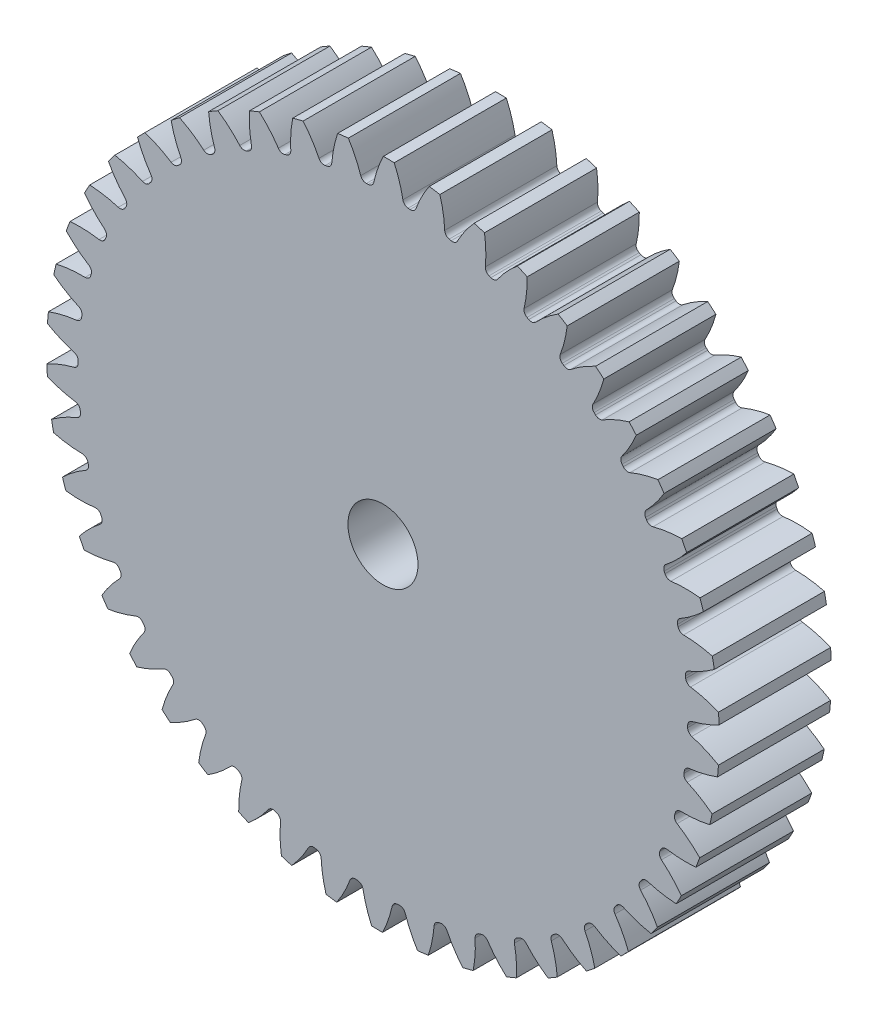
from build123d import *

# Parameters (mm, degrees)
SKETCH3_R         = 304.8
GEARBODY_DEPTH    = 101.6
TOOTHCUT_DEPTH    = 443.864132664
CIRPATTERN1_COUNT = 46
BOREDIA_R         = 31.75
BORE_DEPTH        = 12700


with BuildPart() as part:
    # Sketch3 → gearBody (new body)
    with BuildSketch(Plane.XY):
        Circle(SKETCH3_R)
    extrude(amount=GEARBODY_DEPTH)

    # Sketch2 → toothCut (cut, through all)
    with BuildSketch(Plane.XY):
        with BuildLine():
            ThreePointArc((276.165386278, -5.73847076), (276.182888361, -4.82315265), (276.197356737, -3.90778156))
            ThreePointArc((276.197356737, -3.90778156), (277.307001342, -0.780254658), (280.089623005, 1.027991))
            ThreePointArc((280.089623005, 1.027991), (292.745181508, 5.101953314), (304.8, 10.709241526))
            ThreePointArc((304.8, 10.709241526), (304.941581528, -5.325383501), (304.240211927, -21.345287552))
            ThreePointArc((304.240211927, -21.345287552), (292.388531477, -15.320505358), (279.88293882, -10.807138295))
            ThreePointArc((279.88293882, -10.807138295), (277.165151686, -8.902835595), (276.165386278, -5.73847076))
        make_face()
    toothcut = extrude(amount=TOOTHCUT_DEPTH, mode=Mode.SUBTRACT)

    # CirPattern1: toothCut ×46 about axis
    cirpattern1_axis = Axis((0, 0, 0), (0, 0, 1))
    for i in range(1, CIRPATTERN1_COUNT):
        add(toothcut.rotate(cirpattern1_axis, i * 360 / CIRPATTERN1_COUNT), mode=Mode.SUBTRACT)

    # boreDia → bore (cut, symmetric)
    with BuildSketch(Plane.XY):
        Circle(BOREDIA_R)
    extrude(amount=BORE_DEPTH, both=True, mode=Mode.SUBTRACT)


solid = part.part
